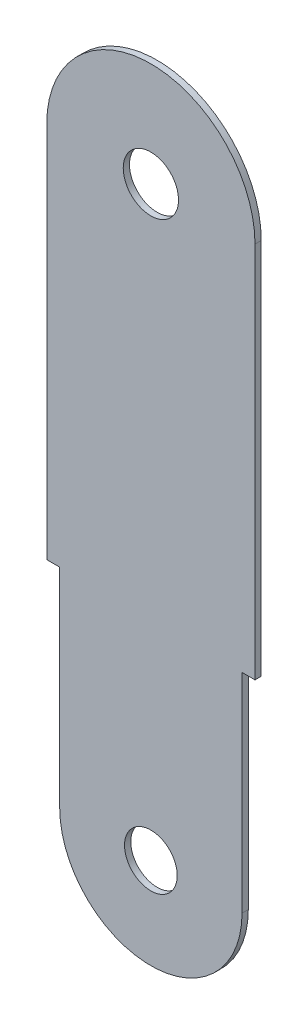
from build123d import *

# Parameters (mm, degrees)
SKETCH1_R           = 6.7437
SKETCH1_R_2         = 6.4262
BOSS_EXTRUDE1_DEPTH = 1.524


with BuildPart() as part:
    # Sketch1 → Boss-Extrude1 (new body)
    with BuildSketch(Plane.XY):
        with BuildLine():
            Line((-34.05306863, -35.011654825), (-34.05306863, -127.07412464))
            Line((-34.05306863, -127.07412464), (-37.211326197, -127.07412464))
            Line((-37.211326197, -127.07412464), (-37.211326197, -177.922739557))
            ThreePointArc((-37.211326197, -177.922739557), (-59.45306863, -200.164481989), (-81.694811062, -177.922739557))
            Line((-81.694811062, -177.922739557), (-81.694811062, -127.07412464))
            Line((-81.694811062, -127.07412464), (-84.85306863, -127.07412464))
            Line((-84.85306863, -127.07412464), (-84.85306863, -35.011654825))
            ThreePointArc((-84.85306863, -35.011654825), (-59.45306863, -9.611654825), (-34.05306863, -35.011654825))
        make_face()
        with Locations(Location((-59.45306863, -35.011654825, 0), (0, 0, 180))):
            Circle(SKETCH1_R, mode=Mode.SUBTRACT)
        with Locations(Location((-59.45306863, -177.922739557, 0), (0, 0, 180))):
            Circle(SKETCH1_R_2, mode=Mode.SUBTRACT)
    extrude(amount=BOSS_EXTRUDE1_DEPTH)


solid = part.part
